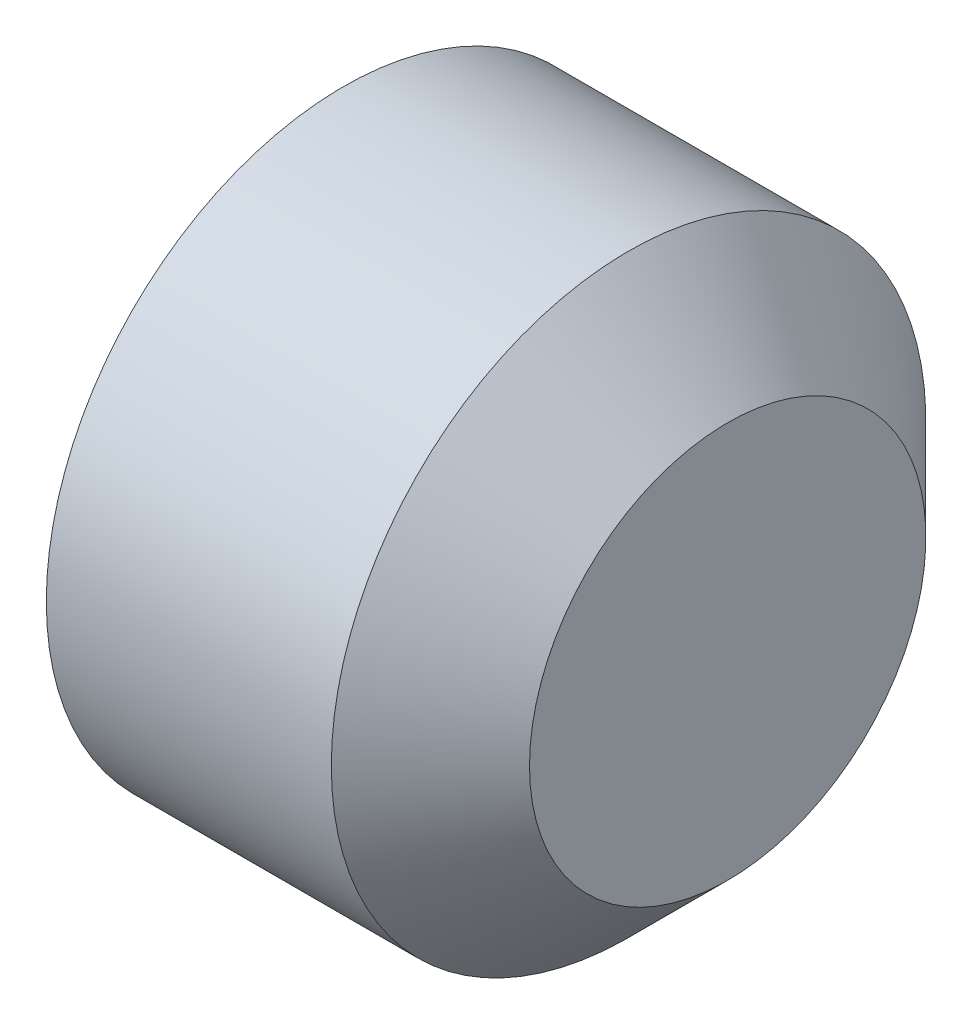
ISO-10303-21;
HEADER;
FILE_DESCRIPTION(('STEP AP214'),'2;1');
FILE_NAME('part.step','',(''),(''),'','','');
FILE_SCHEMA(('AUTOMOTIVE_DESIGN { 1 0 10303 214 1 1 1 1 }'));
ENDSEC;
DATA;
#1=APPLICATION_CONTEXT('core data for automotive mechanical design processes');
#2=APPLICATION_PROTOCOL_DEFINITION('international standard','automotive_design',2000,#1);
#3=PRODUCT_CONTEXT('',#1,'mechanical');
#4=PRODUCT('Part','Part','',(#3));
#5=PRODUCT_RELATED_PRODUCT_CATEGORY('part','',(#4));
#6=PRODUCT_DEFINITION_FORMATION('','',#4);
#7=PRODUCT_DEFINITION_CONTEXT('part definition',#1,'design');
#8=PRODUCT_DEFINITION('design','',#6,#7);
#9=PRODUCT_DEFINITION_SHAPE('','',#8);
#10=(LENGTH_UNIT() NAMED_UNIT(*) SI_UNIT(.MILLI.,.METRE.));
#11=(NAMED_UNIT(*) PLANE_ANGLE_UNIT() SI_UNIT($,.RADIAN.));
#12=(NAMED_UNIT(*) SI_UNIT($,.STERADIAN.) SOLID_ANGLE_UNIT());
#13=UNCERTAINTY_MEASURE_WITH_UNIT(LENGTH_MEASURE(1.E-05),#10,'distance_accuracy_value','');
#14=(GEOMETRIC_REPRESENTATION_CONTEXT(3) GLOBAL_UNCERTAINTY_ASSIGNED_CONTEXT((#13)) GLOBAL_UNIT_ASSIGNED_CONTEXT((#10,
#11,#12)) REPRESENTATION_CONTEXT('',''));
#15=CARTESIAN_POINT('',(0.,0.,0.));
#16=DIRECTION('',(0.,0.,1.));
#17=DIRECTION('',(1.,0.,0.));
#18=AXIS2_PLACEMENT_3D('',#15,#16,#17);
#19=CARTESIAN_POINT('',(0.,0.,0.));
#20=DIRECTION('',(-1.,0.,0.));
#21=DIRECTION('',(0.,0.,1.));
#22=AXIS2_PLACEMENT_3D('',#19,#20,#21);
#23=PLANE('',#22);
#24=CARTESIAN_POINT('',(0.,0.,0.));
#25=DIRECTION('',(-1.,0.,0.));
#26=DIRECTION('',(0.,0.,1.));
#27=AXIS2_PLACEMENT_3D('',#24,#25,#26);
#28=CIRCLE('',#27,1.2195);
#29=CARTESIAN_POINT('',(0.,0.,1.2195));
#30=VERTEX_POINT('',#29);
#31=EDGE_CURVE('E136',#30,#30,#28,.T.);
#32=ORIENTED_EDGE('',*,*,#31,.T.);
#33=EDGE_LOOP('',(#32));
#34=FACE_BOUND('',#33,.T.);
#35=DIRECTION('',(0.,0.,-1.));
#36=VECTOR('',#35,1.);
#37=CARTESIAN_POINT('',(0.,0.750000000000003,0.433012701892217));
#38=LINE('',#37,#36);
#39=CARTESIAN_POINT('',(0.,0.750000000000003,0.433012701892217));
#40=VERTEX_POINT('',#39);
#41=CARTESIAN_POINT('',(0.,0.750000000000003,-0.433012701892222));
#42=VERTEX_POINT('',#41);
#43=EDGE_CURVE('E127',#40,#42,#38,.T.);
#44=ORIENTED_EDGE('',*,*,#43,.F.);
#45=DIRECTION('',(0.,-0.866025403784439,0.5));
#46=VECTOR('',#45,1.);
#47=CARTESIAN_POINT('',(0.,0.750000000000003,0.433012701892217));
#48=LINE('',#47,#46);
#49=CARTESIAN_POINT('',(0.,0.,0.866025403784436));
#50=VERTEX_POINT('',#49);
#51=EDGE_CURVE('E49',#40,#50,#48,.T.);
#52=ORIENTED_EDGE('',*,*,#51,.T.);
#53=DIRECTION('',(0.,0.866025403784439,0.5));
#54=VECTOR('',#53,1.);
#55=CARTESIAN_POINT('',(0.,-0.749999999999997,0.433012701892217));
#56=LINE('',#55,#54);
#57=CARTESIAN_POINT('',(0.,-0.749999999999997,0.433012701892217));
#58=VERTEX_POINT('',#57);
#59=EDGE_CURVE('E118',#58,#50,#56,.T.);
#60=ORIENTED_EDGE('',*,*,#59,.F.);
#61=DIRECTION('',(0.,0.,-1.));
#62=VECTOR('',#61,1.);
#63=CARTESIAN_POINT('',(0.,-0.749999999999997,0.433012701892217));
#64=LINE('',#63,#62);
#65=CARTESIAN_POINT('',(0.,-0.749999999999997,-0.433012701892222));
#66=VERTEX_POINT('',#65);
#67=EDGE_CURVE('E121',#58,#66,#64,.T.);
#68=ORIENTED_EDGE('',*,*,#67,.T.);
#69=DIRECTION('',(0.,0.866025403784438,-0.5));
#70=VECTOR('',#69,1.);
#71=CARTESIAN_POINT('',(0.,-0.749999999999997,-0.433012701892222));
#72=LINE('',#71,#70);
#73=CARTESIAN_POINT('',(0.,0.,-0.866025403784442));
#74=VERTEX_POINT('',#73);
#75=EDGE_CURVE('E124',#66,#74,#72,.T.);
#76=ORIENTED_EDGE('',*,*,#75,.T.);
#77=DIRECTION('',(0.,-0.866025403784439,-0.5));
#78=VECTOR('',#77,1.);
#79=CARTESIAN_POINT('',(0.,0.750000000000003,-0.433012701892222));
#80=LINE('',#79,#78);
#81=EDGE_CURVE('E107',#42,#74,#80,.T.);
#82=ORIENTED_EDGE('',*,*,#81,.F.);
#83=EDGE_LOOP('',(#44,#52,#60,#68,#76,#82));
#84=FACE_BOUND('',#83,.T.);
#85=ADVANCED_FACE('F34',(#34,#84),#23,.T.);
#86=CARTESIAN_POINT('',(2.1,1.,0.));
#87=DIRECTION('',(1.,0.,0.));
#88=DIRECTION('',(0.,0.,-1.));
#89=AXIS2_PLACEMENT_3D('',#86,#87,#88);
#90=PLANE('',#89);
#91=CARTESIAN_POINT('',(2.1,0.,0.));
#92=DIRECTION('',(-1.,0.,0.));
#93=DIRECTION('',(0.,0.,1.));
#94=AXIS2_PLACEMENT_3D('',#91,#92,#93);
#95=CIRCLE('',#94,1.);
#96=CARTESIAN_POINT('',(2.1,0.,1.));
#97=VERTEX_POINT('',#96);
#98=EDGE_CURVE('E11',#97,#97,#95,.T.);
#99=ORIENTED_EDGE('',*,*,#98,.F.);
#100=EDGE_LOOP('',(#99));
#101=FACE_BOUND('',#100,.T.);
#102=ADVANCED_FACE('F36',(#101),#90,.T.);
#103=CARTESIAN_POINT('',(1.60000000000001,0.,0.));
#104=DIRECTION('',(-1.,0.,0.));
#105=DIRECTION('',(0.,0.,1.));
#106=AXIS2_PLACEMENT_3D('',#103,#104,#105);
#107=CONICAL_SURFACE('',#106,1.5,0.785398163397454);
#108=ORIENTED_EDGE('',*,*,#98,.T.);
#109=EDGE_LOOP('',(#108));
#110=FACE_BOUND('',#109,.T.);
#111=CARTESIAN_POINT('',(1.60000000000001,0.,0.));
#112=DIRECTION('',(-1.,0.,0.));
#113=DIRECTION('',(0.,0.,1.));
#114=AXIS2_PLACEMENT_3D('',#111,#112,#113);
#115=CIRCLE('',#114,1.5);
#116=CARTESIAN_POINT('',(1.60000000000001,0.,1.5));
#117=VERTEX_POINT('',#116);
#118=EDGE_CURVE('E42',#117,#117,#115,.T.);
#119=ORIENTED_EDGE('',*,*,#118,.F.);
#120=EDGE_LOOP('',(#119));
#121=FACE_BOUND('',#120,.T.);
#122=ADVANCED_FACE('F147',(#110,#121),#107,.T.);
#123=CARTESIAN_POINT('',(-12.7,0.,0.));
#124=DIRECTION('',(-1.,0.,0.));
#125=DIRECTION('',(0.,0.,1.));
#126=AXIS2_PLACEMENT_3D('',#123,#124,#125);
#127=CYLINDRICAL_SURFACE('',#126,1.5);
#128=ORIENTED_EDGE('',*,*,#118,.T.);
#129=EDGE_LOOP('',(#128));
#130=FACE_BOUND('',#129,.T.);
#131=CARTESIAN_POINT('',(0.161946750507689,0.,0.));
#132=DIRECTION('',(-1.,0.,0.));
#133=DIRECTION('',(0.,0.,1.));
#134=AXIS2_PLACEMENT_3D('',#131,#132,#133);
#135=CIRCLE('',#134,1.5);
#136=CARTESIAN_POINT('',(0.161946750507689,0.,1.5));
#137=VERTEX_POINT('',#136);
#138=EDGE_CURVE('E139',#137,#137,#135,.T.);
#139=ORIENTED_EDGE('',*,*,#138,.F.);
#140=EDGE_LOOP('',(#139));
#141=FACE_BOUND('',#140,.T.);
#142=ADVANCED_FACE('F144',(#130,#141),#127,.T.);
#143=CARTESIAN_POINT('',(0.,0.,0.));
#144=DIRECTION('',(1.,0.,0.));
#145=DIRECTION('',(0.,0.,-1.));
#146=AXIS2_PLACEMENT_3D('',#143,#144,#145);
#147=CONICAL_SURFACE('',#146,1.2195,1.0471975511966);
#148=ORIENTED_EDGE('',*,*,#138,.T.);
#149=EDGE_LOOP('',(#148));
#150=FACE_BOUND('',#149,.T.);
#151=ORIENTED_EDGE('',*,*,#31,.F.);
#152=EDGE_LOOP('',(#151));
#153=FACE_BOUND('',#152,.T.);
#154=ADVANCED_FACE('F154',(#150,#153),#147,.T.);
#155=CARTESIAN_POINT('',(1.2,0.750000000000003,0.433012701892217));
#156=DIRECTION('',(0.,-0.5,-0.866025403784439));
#157=DIRECTION('',(0.,0.866025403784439,-0.5));
#158=AXIS2_PLACEMENT_3D('',#155,#156,#157);
#159=PLANE('',#158);
#160=ORIENTED_EDGE('',*,*,#51,.F.);
#161=DIRECTION('',(-1.,0.,0.));
#162=VECTOR('',#161,1.);
#163=CARTESIAN_POINT('',(1.2,0.750000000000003,0.433012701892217));
#164=LINE('',#163,#162);
#165=CARTESIAN_POINT('',(1.2,0.750000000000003,0.433012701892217));
#166=VERTEX_POINT('',#165);
#167=EDGE_CURVE('E54',#166,#40,#164,.T.);
#168=ORIENTED_EDGE('',*,*,#167,.F.);
#169=DIRECTION('',(0.,-0.866025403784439,0.5));
#170=VECTOR('',#169,1.);
#171=CARTESIAN_POINT('',(1.2,0.750000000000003,0.433012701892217));
#172=LINE('',#171,#170);
#173=CARTESIAN_POINT('',(1.2,0.,0.866025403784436));
#174=VERTEX_POINT('',#173);
#175=EDGE_CURVE('E81',#166,#174,#172,.T.);
#176=ORIENTED_EDGE('',*,*,#175,.T.);
#177=DIRECTION('',(-1.,0.,0.));
#178=VECTOR('',#177,1.);
#179=CARTESIAN_POINT('',(1.2,0.,0.866025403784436));
#180=LINE('',#179,#178);
#181=EDGE_CURVE('E134',#174,#50,#180,.T.);
#182=ORIENTED_EDGE('',*,*,#181,.T.);
#183=EDGE_LOOP('',(#160,#168,#176,#182));
#184=FACE_BOUND('',#183,.T.);
#185=ADVANCED_FACE('F165',(#184),#159,.T.);
#186=CARTESIAN_POINT('',(1.2,-0.749999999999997,0.433012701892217));
#187=DIRECTION('',(0.,-0.5,0.866025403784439));
#188=DIRECTION('',(0.,-0.866025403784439,-0.5));
#189=AXIS2_PLACEMENT_3D('',#186,#187,#188);
#190=PLANE('',#189);
#191=ORIENTED_EDGE('',*,*,#59,.T.);
#192=ORIENTED_EDGE('',*,*,#181,.F.);
#193=DIRECTION('',(0.,0.866025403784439,0.5));
#194=VECTOR('',#193,1.);
#195=CARTESIAN_POINT('',(1.2,-0.749999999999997,0.433012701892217));
#196=LINE('',#195,#194);
#197=CARTESIAN_POINT('',(1.2,-0.749999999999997,0.433012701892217));
#198=VERTEX_POINT('',#197);
#199=EDGE_CURVE('E269',#198,#174,#196,.T.);
#200=ORIENTED_EDGE('',*,*,#199,.F.);
#201=DIRECTION('',(-1.,0.,0.));
#202=VECTOR('',#201,1.);
#203=CARTESIAN_POINT('',(1.2,-0.749999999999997,0.433012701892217));
#204=LINE('',#203,#202);
#205=EDGE_CURVE('E132',#198,#58,#204,.T.);
#206=ORIENTED_EDGE('',*,*,#205,.T.);
#207=EDGE_LOOP('',(#191,#192,#200,#206));
#208=FACE_BOUND('',#207,.T.);
#209=ADVANCED_FACE('F172',(#208),#190,.F.);
#210=CARTESIAN_POINT('',(1.2,-0.749999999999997,0.433012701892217));
#211=DIRECTION('',(0.,1.,0.));
#212=DIRECTION('',(0.,0.,1.));
#213=AXIS2_PLACEMENT_3D('',#210,#211,#212);
#214=PLANE('',#213);
#215=ORIENTED_EDGE('',*,*,#67,.F.);
#216=ORIENTED_EDGE('',*,*,#205,.F.);
#217=DIRECTION('',(0.,0.,-1.));
#218=VECTOR('',#217,1.);
#219=CARTESIAN_POINT('',(1.2,-0.749999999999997,0.433012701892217));
#220=LINE('',#219,#218);
#221=CARTESIAN_POINT('',(1.2,-0.749999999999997,-0.433012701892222));
#222=VERTEX_POINT('',#221);
#223=EDGE_CURVE('E102',#198,#222,#220,.T.);
#224=ORIENTED_EDGE('',*,*,#223,.T.);
#225=DIRECTION('',(-1.,0.,0.));
#226=VECTOR('',#225,1.);
#227=CARTESIAN_POINT('',(1.2,-0.749999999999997,-0.433012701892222));
#228=LINE('',#227,#226);
#229=EDGE_CURVE('E97',#222,#66,#228,.T.);
#230=ORIENTED_EDGE('',*,*,#229,.T.);
#231=EDGE_LOOP('',(#215,#216,#224,#230));
#232=FACE_BOUND('',#231,.T.);
#233=ADVANCED_FACE('F179',(#232),#214,.T.);
#234=CARTESIAN_POINT('',(1.2,-0.749999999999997,-0.433012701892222));
#235=DIRECTION('',(0.,0.5,0.866025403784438));
#236=DIRECTION('',(0.,-0.866025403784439,0.5));
#237=AXIS2_PLACEMENT_3D('',#234,#235,#236);
#238=PLANE('',#237);
#239=ORIENTED_EDGE('',*,*,#75,.F.);
#240=ORIENTED_EDGE('',*,*,#229,.F.);
#241=DIRECTION('',(0.,0.866025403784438,-0.5));
#242=VECTOR('',#241,1.);
#243=CARTESIAN_POINT('',(1.2,-0.749999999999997,-0.433012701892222));
#244=LINE('',#243,#242);
#245=CARTESIAN_POINT('',(1.2,0.,-0.866025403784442));
#246=VERTEX_POINT('',#245);
#247=EDGE_CURVE('E92',#222,#246,#244,.T.);
#248=ORIENTED_EDGE('',*,*,#247,.T.);
#249=DIRECTION('',(-1.,0.,0.));
#250=VECTOR('',#249,1.);
#251=CARTESIAN_POINT('',(1.2,0.,-0.866025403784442));
#252=LINE('',#251,#250);
#253=EDGE_CURVE('E96',#246,#74,#252,.T.);
#254=ORIENTED_EDGE('',*,*,#253,.T.);
#255=EDGE_LOOP('',(#239,#240,#248,#254));
#256=FACE_BOUND('',#255,.T.);
#257=ADVANCED_FACE('F95',(#256),#238,.T.);
#258=CARTESIAN_POINT('',(1.2,0.750000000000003,-0.433012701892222));
#259=DIRECTION('',(0.,0.5,-0.866025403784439));
#260=DIRECTION('',(0.,0.866025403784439,0.5));
#261=AXIS2_PLACEMENT_3D('',#258,#259,#260);
#262=PLANE('',#261);
#263=ORIENTED_EDGE('',*,*,#81,.T.);
#264=ORIENTED_EDGE('',*,*,#253,.F.);
#265=DIRECTION('',(0.,-0.866025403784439,-0.5));
#266=VECTOR('',#265,1.);
#267=CARTESIAN_POINT('',(1.2,0.750000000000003,-0.433012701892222));
#268=LINE('',#267,#266);
#269=CARTESIAN_POINT('',(1.2,0.750000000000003,-0.433012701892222));
#270=VERTEX_POINT('',#269);
#271=EDGE_CURVE('E101',#270,#246,#268,.T.);
#272=ORIENTED_EDGE('',*,*,#271,.F.);
#273=DIRECTION('',(-1.,0.,0.));
#274=VECTOR('',#273,1.);
#275=CARTESIAN_POINT('',(1.2,0.750000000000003,-0.433012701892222));
#276=LINE('',#275,#274);
#277=EDGE_CURVE('E77',#270,#42,#276,.T.);
#278=ORIENTED_EDGE('',*,*,#277,.T.);
#279=EDGE_LOOP('',(#263,#264,#272,#278));
#280=FACE_BOUND('',#279,.T.);
#281=ADVANCED_FACE('F104',(#280),#262,.F.);
#282=CARTESIAN_POINT('',(1.2,0.750000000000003,0.433012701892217));
#283=DIRECTION('',(0.,1.,0.));
#284=DIRECTION('',(0.,0.,1.));
#285=AXIS2_PLACEMENT_3D('',#282,#283,#284);
#286=PLANE('',#285);
#287=ORIENTED_EDGE('',*,*,#43,.T.);
#288=ORIENTED_EDGE('',*,*,#277,.F.);
#289=DIRECTION('',(0.,0.,-1.));
#290=VECTOR('',#289,1.);
#291=CARTESIAN_POINT('',(1.2,0.750000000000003,0.433012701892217));
#292=LINE('',#291,#290);
#293=EDGE_CURVE('E112',#166,#270,#292,.T.);
#294=ORIENTED_EDGE('',*,*,#293,.F.);
#295=ORIENTED_EDGE('',*,*,#167,.T.);
#296=EDGE_LOOP('',(#287,#288,#294,#295));
#297=FACE_BOUND('',#296,.T.);
#298=ADVANCED_FACE('F191',(#297),#286,.F.);
#299=CARTESIAN_POINT('',(1.2,-0.749999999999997,1.29903810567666));
#300=DIRECTION('',(1.,0.,0.));
#301=DIRECTION('',(0.,0.,-1.));
#302=AXIS2_PLACEMENT_3D('',#299,#300,#301);
#303=PLANE('',#302);
#304=ORIENTED_EDGE('',*,*,#175,.F.);
#305=ORIENTED_EDGE('',*,*,#293,.T.);
#306=ORIENTED_EDGE('',*,*,#271,.T.);
#307=ORIENTED_EDGE('',*,*,#247,.F.);
#308=ORIENTED_EDGE('',*,*,#223,.F.);
#309=ORIENTED_EDGE('',*,*,#199,.T.);
#310=EDGE_LOOP('',(#304,#305,#306,#307,#308,#309));
#311=FACE_BOUND('',#310,.T.);
#312=ADVANCED_FACE('F110',(#311),#303,.F.);
#313=CLOSED_SHELL('',(#85,#102,#122,#142,#154,#185,#209,#233,#257,#281,#298,#312));
#314=MANIFOLD_SOLID_BREP('B2',#313);
#315=ADVANCED_BREP_SHAPE_REPRESENTATION('',(#18,#314),#14);
#316=SHAPE_DEFINITION_REPRESENTATION(#9,#315);
ENDSEC;
END-ISO-10303-21;
